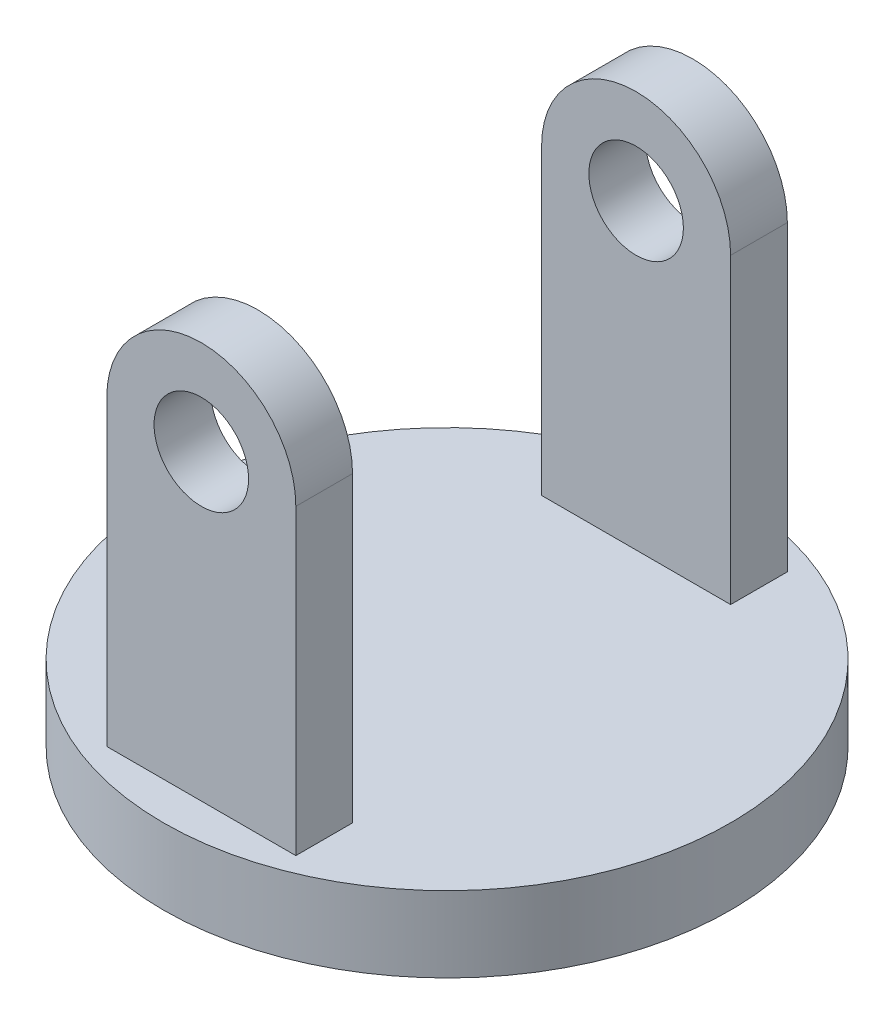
from build123d import *

# Parameters (mm, degrees)
SKETCH1_R           = 75
BOSS_EXTRUDE1_DEPTH = 20
SKETCH2_R           = 12.5
BOSS_EXTRUDE2_DEPTH = 15


with BuildPart() as part:
    # Sketch1 → Boss-Extrude1 (new body)
    with BuildSketch(Plane(origin=(0, 0, 0), x_dir=(1, 0, 0), z_dir=(0, 1, 0))):
        with Locations(Location((0, 0, 0), (0, 0, 270))):
            Circle(SKETCH1_R)
    extrude(amount=BOSS_EXTRUDE1_DEPTH)

    # Sketch2 → Boss-Extrude2 (add)
    with BuildSketch(Plane.XY.offset(50)):
        with BuildLine():
            Line((25, 20), (-25, 20))
            Line((-25, 20), (-25, 100))
            ThreePointArc((-25, 100), (0, 125), (25, 100))
            Line((25, 100), (25, 20))
        make_face()
        with Locations((0, 100)):
            Circle(SKETCH2_R, mode=Mode.SUBTRACT)
    boss_extrude2 = extrude(amount=BOSS_EXTRUDE2_DEPTH)

    # Mirror1: Boss-Extrude2 across plane
    add(boss_extrude2.mirror(Plane.XY))


solid = part.part
